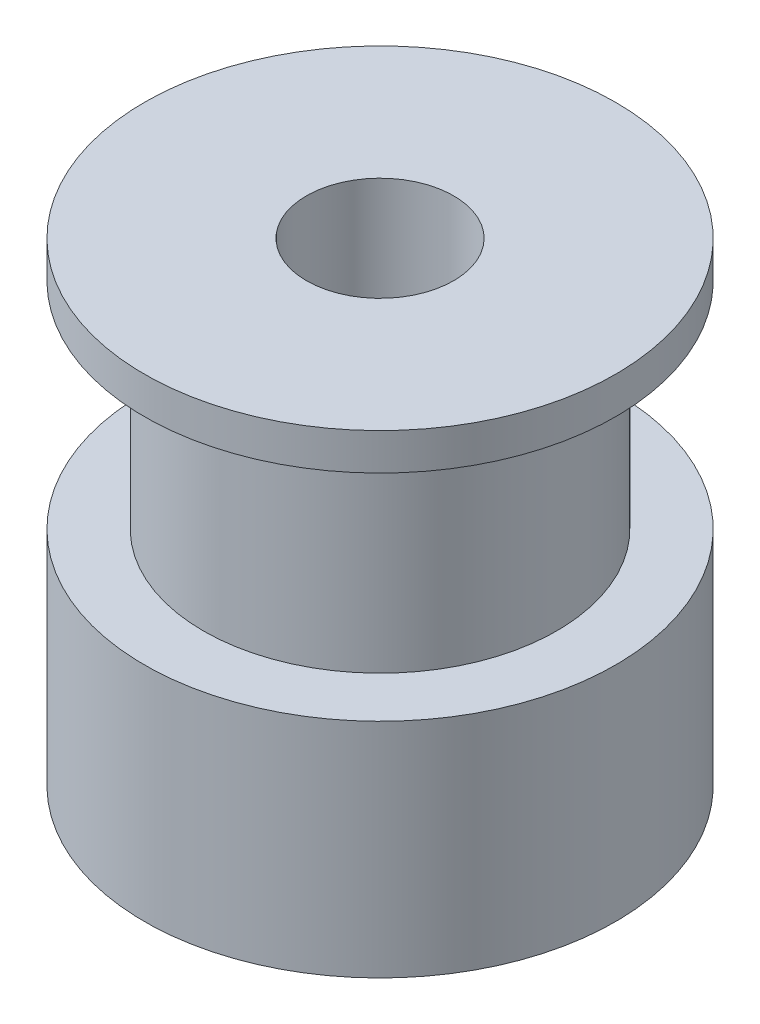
from build123d import *

# Parameters (mm, degrees)
CROQUIS2_R            = 2.5
CORTAR_EXTRUIR1_DEPTH = 20.677652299


with BuildPart() as part:
    # Croquis1 → Revoluci_n1 (revolve)
    with BuildSketch(Plane.XY, mode=Mode.PRIVATE) as revoluci_n1_sk:
        Polygon((0, 0), (0, 16.1), (8, 16.1), (8, 14.85), (6, 14.85), (6, 7.55), (8, 7.55), (8, 0), align=None)
    revolve(revoluci_n1_sk.sketch.rotate(Axis((0, 0, 0), (0, 1, 0)), 90), axis=Axis((0, 0, 0), (0, 1, 0)))

    # Croquis2 → Cortar-Extruir1 (cut, through all)
    with BuildSketch(Plane(origin=(0, 16.1, 0), x_dir=(1, 0, 0), z_dir=(0, 1, 0))):
        with Locations(Location((0, 0, 0), (0, 0, 270))):
            Circle(CROQUIS2_R)
    extrude(amount=-CORTAR_EXTRUIR1_DEPTH, mode=Mode.SUBTRACT)


solid = part.part
